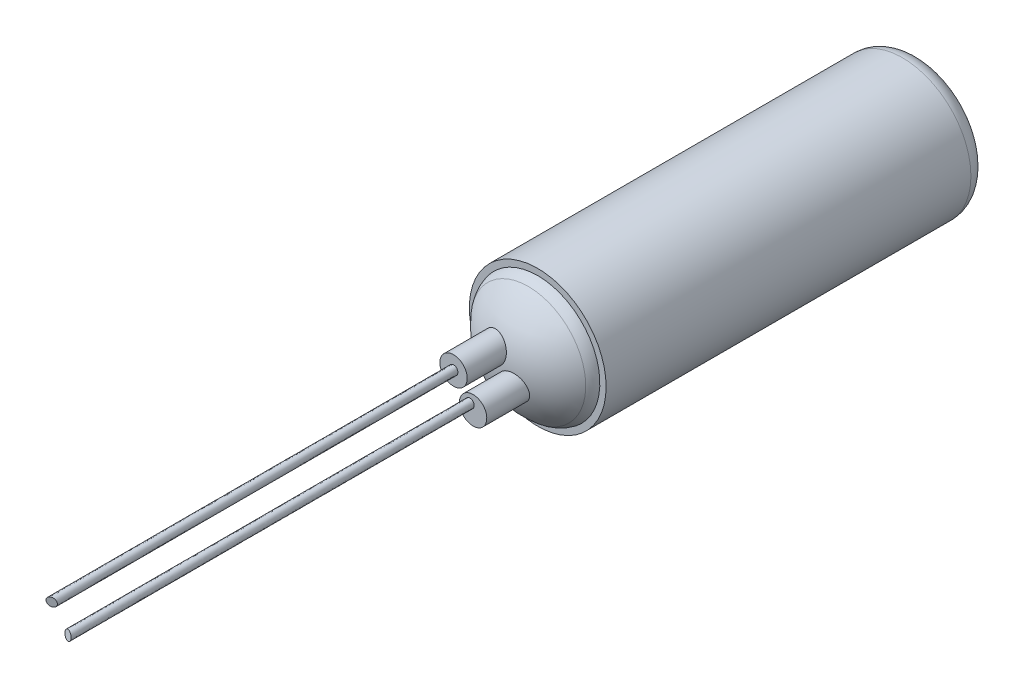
ISO-10303-21;
HEADER;
FILE_DESCRIPTION(('STEP AP214'),'2;1');
FILE_NAME('part.step','',(''),(''),'','','');
FILE_SCHEMA(('AUTOMOTIVE_DESIGN { 1 0 10303 214 1 1 1 1 }'));
ENDSEC;
DATA;
#1=APPLICATION_CONTEXT('core data for automotive mechanical design processes');
#2=APPLICATION_PROTOCOL_DEFINITION('international standard','automotive_design',2000,#1);
#3=PRODUCT_CONTEXT('',#1,'mechanical');
#4=PRODUCT('Part','Part','',(#3));
#5=PRODUCT_RELATED_PRODUCT_CATEGORY('part','',(#4));
#6=PRODUCT_DEFINITION_FORMATION('','',#4);
#7=PRODUCT_DEFINITION_CONTEXT('part definition',#1,'design');
#8=PRODUCT_DEFINITION('design','',#6,#7);
#9=PRODUCT_DEFINITION_SHAPE('','',#8);
#10=(LENGTH_UNIT() NAMED_UNIT(*) SI_UNIT(.MILLI.,.METRE.));
#11=(NAMED_UNIT(*) PLANE_ANGLE_UNIT() SI_UNIT($,.RADIAN.));
#12=(NAMED_UNIT(*) SI_UNIT($,.STERADIAN.) SOLID_ANGLE_UNIT());
#13=UNCERTAINTY_MEASURE_WITH_UNIT(LENGTH_MEASURE(1.E-05),#10,'distance_accuracy_value','');
#14=(GEOMETRIC_REPRESENTATION_CONTEXT(3) GLOBAL_UNCERTAINTY_ASSIGNED_CONTEXT((#13)) GLOBAL_UNIT_ASSIGNED_CONTEXT((#10,
#11,#12)) REPRESENTATION_CONTEXT('',''));
#15=CARTESIAN_POINT('',(0.,0.,0.));
#16=DIRECTION('',(0.,0.,1.));
#17=DIRECTION('',(1.,0.,0.));
#18=AXIS2_PLACEMENT_3D('',#15,#16,#17);
#19=CARTESIAN_POINT('',(3.98137501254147,6.56502224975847,9.95298394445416));
#20=DIRECTION('',(0.,0.,-1.));
#21=DIRECTION('',(-1.,0.,0.));
#22=AXIS2_PLACEMENT_3D('',#19,#20,#21);
#23=PLANE('',#22);
#24=CARTESIAN_POINT('',(3.98137501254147,5.04102224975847,9.95298394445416));
#25=DIRECTION('',(0.,0.,-1.));
#26=DIRECTION('',(-1.,0.,0.));
#27=AXIS2_PLACEMENT_3D('',#24,#25,#26);
#28=CIRCLE('',#27,1.38412585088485);
#29=CARTESIAN_POINT('',(2.59724916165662,5.04102224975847,9.95298394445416));
#30=VERTEX_POINT('',#29);
#31=EDGE_CURVE('E17',#30,#30,#28,.T.);
#32=ORIENTED_EDGE('',*,*,#31,.T.);
#33=EDGE_LOOP('',(#32));
#34=FACE_BOUND('',#33,.T.);
#35=CARTESIAN_POINT('',(3.98137501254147,5.04102224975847,9.95298394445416));
#36=DIRECTION('',(0.,0.,1.));
#37=DIRECTION('',(1.,0.,0.));
#38=AXIS2_PLACEMENT_3D('',#35,#36,#37);
#39=CIRCLE('',#38,1.524);
#40=CARTESIAN_POINT('',(5.50537501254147,5.04102224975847,9.95298394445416));
#41=VERTEX_POINT('',#40);
#42=EDGE_CURVE('E9',#41,#41,#39,.T.);
#43=ORIENTED_EDGE('',*,*,#42,.T.);
#44=EDGE_LOOP('',(#43));
#45=FACE_BOUND('',#44,.T.);
#46=ADVANCED_FACE('F14',(#34,#45),#23,.F.);
#47=CARTESIAN_POINT('',(3.98137501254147,5.04102224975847,12.7757059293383));
#48=DIRECTION('',(0.,0.,1.));
#49=DIRECTION('',(1.,0.,0.));
#50=AXIS2_PLACEMENT_3D('',#47,#48,#49);
#51=CYLINDRICAL_SURFACE('',#50,1.524);
#52=ORIENTED_EDGE('',*,*,#42,.F.);
#53=EDGE_LOOP('',(#52));
#54=FACE_BOUND('',#53,.T.);
#55=CARTESIAN_POINT('',(3.98137501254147,5.04102224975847,1.82498394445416));
#56=DIRECTION('',(0.,0.,1.));
#57=DIRECTION('',(1.,0.,0.));
#58=AXIS2_PLACEMENT_3D('',#55,#56,#57);
#59=CIRCLE('',#58,1.524);
#60=CARTESIAN_POINT('',(5.50537501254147,5.04102224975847,1.82498394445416));
#61=VERTEX_POINT('',#60);
#62=EDGE_CURVE('E23',#61,#61,#59,.T.);
#63=ORIENTED_EDGE('',*,*,#62,.T.);
#64=EDGE_LOOP('',(#63));
#65=FACE_BOUND('',#64,.T.);
#66=ADVANCED_FACE('F119',(#54,#65),#51,.T.);
#67=CARTESIAN_POINT('',(3.98137501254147,5.04102224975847,1.82498394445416));
#68=DIRECTION('',(0.,0.,1.));
#69=DIRECTION('',(1.,0.,0.));
#70=AXIS2_PLACEMENT_3D('',#67,#68,#69);
#71=TOROIDAL_SURFACE('',#70,1.143,0.381000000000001);
#72=ORIENTED_EDGE('',*,*,#62,.F.);
#73=EDGE_LOOP('',(#72));
#74=FACE_BOUND('',#73,.T.);
#75=CARTESIAN_POINT('',(3.98137501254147,5.04102224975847,1.44398394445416));
#76=DIRECTION('',(0.,0.,1.));
#77=DIRECTION('',(1.,0.,0.));
#78=AXIS2_PLACEMENT_3D('',#75,#76,#77);
#79=CIRCLE('',#78,1.14300000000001);
#80=CARTESIAN_POINT('',(5.12437501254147,5.04102224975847,1.44398394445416));
#81=VERTEX_POINT('',#80);
#82=EDGE_CURVE('E98',#81,#81,#79,.T.);
#83=ORIENTED_EDGE('',*,*,#82,.T.);
#84=EDGE_LOOP('',(#83));
#85=FACE_BOUND('',#84,.T.);
#86=ADVANCED_FACE('F116',(#74,#85),#71,.T.);
#87=CARTESIAN_POINT('',(3.98137501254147,6.18402224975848,1.44398394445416));
#88=DIRECTION('',(0.,0.,1.));
#89=DIRECTION('',(1.,0.,0.));
#90=AXIS2_PLACEMENT_3D('',#87,#88,#89);
#91=PLANE('',#90);
#92=ORIENTED_EDGE('',*,*,#82,.F.);
#93=EDGE_LOOP('',(#92));
#94=FACE_BOUND('',#93,.T.);
#95=ADVANCED_FACE('F112',(#94),#91,.F.);
#96=CARTESIAN_POINT('',(3.98137501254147,5.04102224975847,9.83934243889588));
#97=DIRECTION('',(0.,0.,-1.));
#98=DIRECTION('',(0.00892276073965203,0.999960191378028,0.));
#99=AXIS2_PLACEMENT_3D('',#96,#97,#98);
#100=TOROIDAL_SURFACE('',#99,0.889,0.508);
#101=CARTESIAN_POINT('',(3.98137501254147,5.04102224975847,10.1630746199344));
#102=DIRECTION('',(0.,0.,-1.));
#103=DIRECTION('',(0.00892276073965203,0.999960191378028,0.));
#104=AXIS2_PLACEMENT_3D('',#101,#102,#103);
#105=CIRCLE('',#104,1.28048623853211);
#106=CARTESIAN_POINT('',(3.99280048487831,6.32145751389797,10.1630746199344));
#107=VERTEX_POINT('',#106);
#108=EDGE_CURVE('E92',#107,#107,#105,.F.);
#109=ORIENTED_EDGE('',*,*,#108,.F.);
#110=EDGE_LOOP('',(#109));
#111=FACE_BOUND('',#110,.T.);
#112=ORIENTED_EDGE('',*,*,#31,.F.);
#113=EDGE_LOOP('',(#112));
#114=FACE_BOUND('',#113,.T.);
#115=ADVANCED_FACE('F106',(#111,#114),#100,.T.);
#116=CARTESIAN_POINT('',(3.98137501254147,5.04102224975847,9.10420061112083));
#117=DIRECTION('',(-0.00892276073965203,-0.999960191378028,0.));
#118=DIRECTION('',(0.999960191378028,-0.00892276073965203,0.));
#119=AXIS2_PLACEMENT_3D('',#116,#117,#118);
#120=SPHERICAL_SURFACE('',#119,1.66158333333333);
#121=CARTESIAN_POINT('',(3.98337896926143,4.54498127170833,10.6900122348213));
#122=CARTESIAN_POINT('',(3.97092117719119,4.55724621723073,10.6938642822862));
#123=CARTESIAN_POINT('',(3.95951601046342,4.5705897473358,10.697748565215));
#124=CARTESIAN_POINT('',(3.9391446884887,4.59905527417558,10.7054697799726));
#125=CARTESIAN_POINT('',(3.93018164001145,4.61417950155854,10.7093066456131));
#126=CARTESIAN_POINT('',(3.91497217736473,4.64577354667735,10.7168225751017));
#127=CARTESIAN_POINT('',(3.90872538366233,4.66224317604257,10.7205016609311));
#128=CARTESIAN_POINT('',(3.89915056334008,4.69605940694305,10.7275983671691));
#129=CARTESIAN_POINT('',(3.8958216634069,4.7134057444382,10.7310160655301));
#130=CARTESIAN_POINT('',(3.89222184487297,4.74833412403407,10.7374674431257));
#131=CARTESIAN_POINT('',(3.89192583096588,4.76591302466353,10.7405040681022));
#132=CARTESIAN_POINT('',(3.89437124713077,4.80093088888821,10.7461389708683));
#133=CARTESIAN_POINT('',(3.89711249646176,4.8183698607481,10.7487372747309));
#134=CARTESIAN_POINT('',(3.90549859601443,4.85222690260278,10.7533705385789));
#135=CARTESIAN_POINT('',(3.9110827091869,4.86865857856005,10.7554159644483));
#136=CARTESIAN_POINT('',(3.92498558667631,4.90038557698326,10.7589524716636));
#137=CARTESIAN_POINT('',(3.93330398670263,4.91568105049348,10.7604436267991));
#138=CARTESIAN_POINT('',(3.95224183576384,4.94435415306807,10.7628012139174));
#139=CARTESIAN_POINT('',(3.96280808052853,4.95776589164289,10.7636803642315));
#140=CARTESIAN_POINT('',(3.98604509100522,4.98265172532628,10.7648391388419));
#141=CARTESIAN_POINT('',(3.99871565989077,4.99412600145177,10.7651188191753));
#142=CARTESIAN_POINT('',(4.02561077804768,5.01465843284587,10.7650707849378));
#143=CARTESIAN_POINT('',(4.03981214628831,5.02374699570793,10.764751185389));
#144=CARTESIAN_POINT('',(4.06949705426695,5.03945422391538,10.7635298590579));
#145=CARTESIAN_POINT('',(4.08498056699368,5.04607294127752,10.7626281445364));
#146=CARTESIAN_POINT('',(4.11678102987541,5.05666570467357,10.7602688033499));
#147=CARTESIAN_POINT('',(4.13309774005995,5.06064050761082,10.7588113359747));
#148=CARTESIAN_POINT('',(4.16610842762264,5.06586050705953,10.7553814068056));
#149=CARTESIAN_POINT('',(4.1828024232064,5.06710557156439,10.7534089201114));
#150=CARTESIAN_POINT('',(4.21632005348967,5.06685841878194,10.7489747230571));
#151=CARTESIAN_POINT('',(4.23314264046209,5.06533122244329,10.7465071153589));
#152=CARTESIAN_POINT('',(4.26624412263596,5.05954518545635,10.7411658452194));
#153=CARTESIAN_POINT('',(4.28252296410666,5.05528607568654,10.7382921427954));
#154=CARTESIAN_POINT('',(4.31443491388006,5.04406495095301,10.7321510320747));
#155=CARTESIAN_POINT('',(4.33004759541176,5.03704864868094,10.7288766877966));
#156=CARTESIAN_POINT('',(4.35984140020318,5.02053899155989,10.7220709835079));
#157=CARTESIAN_POINT('',(4.37402236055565,5.01104535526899,10.7185395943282));
#158=CARTESIAN_POINT('',(4.40085887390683,4.98963375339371,10.7112370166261));
#159=CARTESIAN_POINT('',(4.41347648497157,4.97766939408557,10.7074623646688));
#160=CARTESIAN_POINT('',(4.436491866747,4.95178631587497,10.6998444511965));
#161=CARTESIAN_POINT('',(4.4468894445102,4.93786742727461,10.6960011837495));
#162=CARTESIAN_POINT('',(4.46529118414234,4.90827927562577,10.6883047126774));
#163=CARTESIAN_POINT('',(4.47326434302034,4.89259059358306,10.6844519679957));
#164=CARTESIAN_POINT('',(4.48640650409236,4.86004492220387,10.6768963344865));
#165=CARTESIAN_POINT('',(4.49157546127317,4.84318791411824,10.6731934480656));
#166=CARTESIAN_POINT('',(4.49893102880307,4.8088218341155,10.6660580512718));
#167=CARTESIAN_POINT('',(4.50112459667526,4.79131438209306,10.6626249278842));
#168=CARTESIAN_POINT('',(4.50245603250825,4.75611439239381,10.6561290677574));
#169=CARTESIAN_POINT('',(4.50159414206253,4.73842186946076,10.653066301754));
#170=CARTESIAN_POINT('',(4.49684402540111,4.70368022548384,10.6474637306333));
#171=CARTESIAN_POINT('',(4.49300811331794,4.68662527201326,10.6449158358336));
#172=CARTESIAN_POINT('',(4.48244926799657,4.65335624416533,10.6403674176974));
#173=CARTESIAN_POINT('',(4.47572676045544,4.63714204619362,10.6383668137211));
#174=CARTESIAN_POINT('',(4.45976756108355,4.60644286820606,10.6350288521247));
#175=CARTESIAN_POINT('',(4.45059734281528,4.59192498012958,10.6336762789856));
#176=CARTESIAN_POINT('',(4.42992403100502,4.56460641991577,10.6316119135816));
#177=CARTESIAN_POINT('',(4.41842124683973,4.55180552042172,10.6309000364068));
#178=CARTESIAN_POINT('',(4.39367124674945,4.5285507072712,10.6301516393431));
#179=CARTESIAN_POINT('',(4.38046432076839,4.51805431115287,10.6301016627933));
#180=CARTESIAN_POINT('',(4.35251129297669,4.49938614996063,10.6306441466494));
#181=CARTESIAN_POINT('',(4.33776527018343,4.49121426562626,10.6312365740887));
#182=CARTESIAN_POINT('',(4.30725064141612,4.47745923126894,10.6330368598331));
#183=CARTESIAN_POINT('',(4.29148841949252,4.47186143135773,10.6342411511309));
#184=CARTESIAN_POINT('',(4.25931362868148,4.46332148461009,10.6372206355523));
#185=CARTESIAN_POINT('',(4.24290106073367,4.46037933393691,10.638995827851));
#186=CARTESIAN_POINT('',(4.20969412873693,4.45718532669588,10.6430799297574));
#187=CARTESIAN_POINT('',(4.19289754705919,4.45696403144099,10.6453946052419));
#188=CARTESIAN_POINT('',(4.15955785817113,4.45926396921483,10.6504713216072));
#189=CARTESIAN_POINT('',(4.14301484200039,4.46178616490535,10.6532335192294));
#190=CARTESIAN_POINT('',(4.11024917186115,4.46956281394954,10.6591874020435));
#191=CARTESIAN_POINT('',(4.09404277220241,4.4748791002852,10.6623875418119));
#192=CARTESIAN_POINT('',(4.06280141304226,4.48810157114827,10.6690667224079));
#193=CARTESIAN_POINT('',(4.04776524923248,4.49600504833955,10.6725454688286));
#194=CARTESIAN_POINT('',(4.02447348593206,4.51083320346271,10.6783738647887));
#195=CARTESIAN_POINT('',(4.01575027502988,4.51705752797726,10.6806708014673));
#196=CARTESIAN_POINT('',(3.9990130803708,4.53038046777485,10.6853118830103));
#197=CARTESIAN_POINT('',(3.99099910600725,4.53747909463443,10.6876560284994));
#198=CARTESIAN_POINT('',(3.98337896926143,4.54498127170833,10.6900122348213));
#199=B_SPLINE_CURVE_WITH_KNOTS('',3,(#121,#122,#123,#124,#125,#126,#127,#128,#129,#130,#131,
#132,#133,#134,#135,#136,#137,#138,#139,#140,#141,#142,#143,#144,#145,#146,#147,#148,#149,#150,
#151,#152,#153,#154,#155,#156,#157,#158,#159,#160,#161,#162,#163,#164,#165,#166,#167,#168,#169,
#170,#171,#172,#173,#174,#175,#176,#177,#178,#179,#180,#181,#182,#183,#184,#185,#186,#187,#188,
#189,#190,#191,#192,#193,#194,#195,#196,#197,#198),.UNSPECIFIED.,.T.,.F.,(4,2,2,2,2,2,2,2,2,2,2,
2,2,2,2,2,2,2,2,2,2,2,2,2,2,2,2,2,2,2,2,2,2,2,2,2,2,2,4),(0.,0.053664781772,0.107397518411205,
0.161122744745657,0.214831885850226,0.268096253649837,0.321357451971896,0.373525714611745,
0.425687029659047,0.476729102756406,0.52776640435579,0.578117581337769,0.628467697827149,
0.67880339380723,0.729141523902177,0.780119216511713,0.831101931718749,0.883143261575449,
0.935190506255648,0.988322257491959,1.04145862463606,1.09524838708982,1.14903901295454,
1.20270363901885,1.25636402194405,1.30910133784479,1.36183087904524,1.41325296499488,
1.4646682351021,1.51503657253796,1.5654023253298,1.61547777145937,1.6655531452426,
1.71619047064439,1.76684556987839,1.81867203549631,1.87044444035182,1.90326948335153,
1.93609496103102),.UNSPECIFIED.);
#200=CARTESIAN_POINT('',(3.98337896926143,4.54498127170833,10.6900122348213));
#201=VERTEX_POINT('',#200);
#202=EDGE_CURVE('E93',#201,#201,#199,.T.);
#203=ORIENTED_EDGE('',*,*,#202,.T.);
#204=EDGE_LOOP('',(#203));
#205=FACE_BOUND('',#204,.T.);
#206=ORIENTED_EDGE('',*,*,#108,.T.);
#207=EDGE_LOOP('',(#206));
#208=FACE_BOUND('',#207,.T.);
#209=CARTESIAN_POINT('',(3.54192608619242,5.10206295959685,10.7054556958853));
#210=CARTESIAN_POINT('',(3.52979674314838,5.1146637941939,10.7016464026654));
#211=CARTESIAN_POINT('',(3.5187512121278,5.12831387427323,10.6977937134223));
#212=CARTESIAN_POINT('',(3.49914990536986,5.15732246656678,10.6901118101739));
#213=CARTESIAN_POINT('',(3.49059734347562,5.17268314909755,10.6862826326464));
#214=CARTESIAN_POINT('',(3.4762456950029,5.20467125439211,10.6787620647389));
#215=CARTESIAN_POINT('',(3.47044606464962,5.22129842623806,10.6750706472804));
#216=CARTESIAN_POINT('',(3.46178646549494,5.25534839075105,10.66793731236));
#217=CARTESIAN_POINT('',(3.45892562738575,5.27277094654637,10.6644953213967));
#218=CARTESIAN_POINT('',(3.45626359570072,5.30778423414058,10.6579932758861));
#219=CARTESIAN_POINT('',(3.45643965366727,5.3253727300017,10.6549305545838));
#220=CARTESIAN_POINT('',(3.45982783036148,5.36033090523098,10.6492591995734));
#221=CARTESIAN_POINT('',(3.46303974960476,5.3777005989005,10.6466505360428));
#222=CARTESIAN_POINT('',(3.47233888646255,5.41132536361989,10.6420302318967));
#223=CARTESIAN_POINT('',(3.47836252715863,5.42759640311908,10.6400069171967));
#224=CARTESIAN_POINT('',(3.49311323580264,5.45893165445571,10.6365563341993));
#225=CARTESIAN_POINT('',(3.50183989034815,5.47399605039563,10.6351289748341));
#226=CARTESIAN_POINT('',(3.52151633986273,5.50211005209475,10.6329503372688));
#227=CARTESIAN_POINT('',(3.53240779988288,5.51519931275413,10.6321836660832));
#228=CARTESIAN_POINT('',(3.55622942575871,5.53939350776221,10.6312974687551));
#229=CARTESIAN_POINT('',(3.56915938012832,5.55049864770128,10.631177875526));
#230=CARTESIAN_POINT('',(3.59647978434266,5.57025308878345,10.6315871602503));
#231=CARTESIAN_POINT('',(3.61084634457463,5.57893565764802,10.6321066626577));
#232=CARTESIAN_POINT('',(3.64077895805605,5.59381825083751,10.6337594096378));
#233=CARTESIAN_POINT('',(3.65634499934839,5.60001829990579,10.6348926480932));
#234=CARTESIAN_POINT('',(3.688265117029,5.60979037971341,10.6377356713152));
#235=CARTESIAN_POINT('',(3.70462075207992,5.61335696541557,10.6394466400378));
#236=CARTESIAN_POINT('',(3.73763297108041,5.61777018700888,10.6433861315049));
#237=CARTESIAN_POINT('',(3.75428957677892,5.61861662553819,10.645614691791));
#238=CARTESIAN_POINT('',(3.78773867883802,5.61758904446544,10.6505595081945));
#239=CARTESIAN_POINT('',(3.80452857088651,5.61566789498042,10.6532835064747));
#240=CARTESIAN_POINT('',(3.83750018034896,5.60910540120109,10.6591063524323));
#241=CARTESIAN_POINT('',(3.85368182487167,5.60446373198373,10.6622052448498));
#242=CARTESIAN_POINT('',(3.88539184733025,5.59246904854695,10.6687638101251));
#243=CARTESIAN_POINT('',(3.90089515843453,5.58505351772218,10.6722303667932));
#244=CARTESIAN_POINT('',(3.93040791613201,5.56775396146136,10.6793579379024));
#245=CARTESIAN_POINT('',(3.94441718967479,5.5578696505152,10.6830189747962));
#246=CARTESIAN_POINT('',(3.97083397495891,5.5356914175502,10.690507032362));
#247=CARTESIAN_POINT('',(3.98320383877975,5.52335324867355,10.6943359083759));
#248=CARTESIAN_POINT('',(4.00566181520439,5.49674643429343,10.7019811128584));
#249=CARTESIAN_POINT('',(4.01574978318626,5.48247766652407,10.7057974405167));
#250=CARTESIAN_POINT('',(4.0334207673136,5.45229250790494,10.7133400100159));
#251=CARTESIAN_POINT('',(4.04098460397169,5.43636465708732,10.7170653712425));
#252=CARTESIAN_POINT('',(4.05326873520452,5.40339911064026,10.7242919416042));
#253=CARTESIAN_POINT('',(4.05798908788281,5.38636143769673,10.7277931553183));
#254=CARTESIAN_POINT('',(4.06439651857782,5.35180083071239,10.7344462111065));
#255=CARTESIAN_POINT('',(4.06610705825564,5.33428274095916,10.7376005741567));
#256=CARTESIAN_POINT('',(4.06648287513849,5.29914456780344,10.7435010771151));
#257=CARTESIAN_POINT('',(4.06514844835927,5.28152449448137,10.746247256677));
#258=CARTESIAN_POINT('',(4.0594932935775,5.24704427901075,10.7512030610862));
#259=CARTESIAN_POINT('',(4.05522999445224,5.23017605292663,10.7534219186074));
#260=CARTESIAN_POINT('',(4.04387106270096,5.19735587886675,10.757324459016));
#261=CARTESIAN_POINT('',(4.03677579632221,5.18140381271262,10.7590082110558));
#262=CARTESIAN_POINT('',(4.02012412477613,5.15123675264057,10.7617598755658));
#263=CARTESIAN_POINT('',(4.01062443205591,5.13699158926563,10.7628403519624));
#264=CARTESIAN_POINT('',(3.98935661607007,5.11027236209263,10.7644090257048));
#265=CARTESIAN_POINT('',(3.97758871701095,5.09779812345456,10.7648972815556));
#266=CARTESIAN_POINT('',(3.95231811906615,5.07516622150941,10.7652642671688));
#267=CARTESIAN_POINT('',(3.93884437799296,5.06497634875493,10.7651521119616));
#268=CARTESIAN_POINT('',(3.91041368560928,5.04696528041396,10.7643426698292));
#269=CARTESIAN_POINT('',(3.89545678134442,5.03914400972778,10.7636454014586));
#270=CARTESIAN_POINT('',(3.86453256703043,5.02609961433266,10.7616885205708));
#271=CARTESIAN_POINT('',(3.84856805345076,5.0208696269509,10.7604304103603));
#272=CARTESIAN_POINT('',(3.81604651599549,5.01310349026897,10.7573878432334));
#273=CARTESIAN_POINT('',(3.79948949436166,5.01056733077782,10.7556033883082));
#274=CARTESIAN_POINT('',(3.76606884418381,5.0082201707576,10.7515360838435));
#275=CARTESIAN_POINT('',(3.74920381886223,5.00843786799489,10.7492482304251));
#276=CARTESIAN_POINT('',(3.71579730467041,5.01163173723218,10.7442468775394));
#277=CARTESIAN_POINT('',(3.69925592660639,5.0146088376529,10.7415332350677));
#278=CARTESIAN_POINT('',(3.66661878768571,5.02329719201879,10.7356947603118));
#279=CARTESIAN_POINT('',(3.650538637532,5.02906213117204,10.7325627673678));
#280=CARTESIAN_POINT('',(3.61962350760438,5.04315730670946,10.7260172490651));
#281=CARTESIAN_POINT('',(3.6047872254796,5.05148481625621,10.7226040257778));
#282=CARTESIAN_POINT('',(3.58192580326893,5.06694359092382,10.7168836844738));
#283=CARTESIAN_POINT('',(3.57340846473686,5.0733812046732,10.7146334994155));
#284=CARTESIAN_POINT('',(3.55710211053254,5.08710380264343,10.7100794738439));
#285=CARTESIAN_POINT('',(3.54931310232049,5.09438879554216,10.7077756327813));
#286=CARTESIAN_POINT('',(3.54192608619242,5.10206295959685,10.7054556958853));
#287=B_SPLINE_CURVE_WITH_KNOTS('',3,(#209,#210,#211,#212,#213,#214,#215,#216,#217,#218,#219,
#220,#221,#222,#223,#224,#225,#226,#227,#228,#229,#230,#231,#232,#233,#234,#235,#236,#237,#238,
#239,#240,#241,#242,#243,#244,#245,#246,#247,#248,#249,#250,#251,#252,#253,#254,#255,#256,#257,
#258,#259,#260,#261,#262,#263,#264,#265,#266,#267,#268,#269,#270,#271,#272,#273,#274,#275,#276,
#277,#278,#279,#280,#281,#282,#283,#284,#285,#286),.UNSPECIFIED.,.T.,.F.,(4,2,2,2,2,2,2,2,2,2,2,
2,2,2,2,2,2,2,2,2,2,2,2,2,2,2,2,2,2,2,2,2,2,2,2,2,2,2,4),(0.,0.0536606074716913,
0.107390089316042,0.161108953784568,0.214811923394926,0.268112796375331,0.321410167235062,
0.373556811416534,0.425695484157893,0.476583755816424,0.527466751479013,0.577612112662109,
0.627756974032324,0.678005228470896,0.72825712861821,0.779374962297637,0.830498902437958,
0.882852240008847,0.935211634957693,0.988618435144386,1.04202861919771,1.09583585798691,
1.14964199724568,1.20302682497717,1.25640646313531,1.30876824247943,1.36112325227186,
1.41234282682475,1.4635573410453,1.51399657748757,1.56443421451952,1.61473755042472,
1.66504069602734,1.71586847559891,1.76671336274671,1.81857890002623,1.87038943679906,
1.90306950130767,1.93574990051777),.UNSPECIFIED.);
#288=CARTESIAN_POINT('',(3.54192608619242,5.10206295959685,10.7054556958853));
#289=VERTEX_POINT('',#288);
#290=EDGE_CURVE('E83',#289,#289,#287,.T.);
#291=ORIENTED_EDGE('',*,*,#290,.T.);
#292=EDGE_LOOP('',(#291));
#293=FACE_BOUND('',#292,.T.);
#294=ADVANCED_FACE('F100',(#205,#208,#293),#120,.T.);
#295=CARTESIAN_POINT('',(4.12399185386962,4.8616252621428,20.5613266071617));
#296=DIRECTION('',(-0.283187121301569,0.101279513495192,0.953702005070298));
#297=DIRECTION('',(-0.958733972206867,-0.00378301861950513,-0.284279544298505));
#298=AXIS2_PLACEMENT_3D('',#295,#296,#297);
#299=PLANE('',#298);
#300=CARTESIAN_POINT('',(4.12399185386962,4.8616252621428,20.5613266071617));
#301=DIRECTION('',(-0.283187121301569,0.101279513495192,0.953702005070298));
#302=DIRECTION('',(-0.958733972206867,-0.00378301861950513,-0.284279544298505));
#303=AXIS2_PLACEMENT_3D('',#300,#301,#302);
#304=CIRCLE('',#303,0.1016);
#305=CARTESIAN_POINT('',(4.0265844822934,4.86124090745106,20.532443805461));
#306=VERTEX_POINT('',#305);
#307=EDGE_CURVE('E33',#306,#306,#304,.T.);
#308=ORIENTED_EDGE('',*,*,#307,.T.);
#309=EDGE_LOOP('',(#308));
#310=FACE_BOUND('',#309,.T.);
#311=ADVANCED_FACE('F105',(#310),#299,.T.);
#312=CARTESIAN_POINT('',(4.0265844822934,4.86124090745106,10.372443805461));
#313=CARTESIAN_POINT('',(4.0265844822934,4.86124090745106,20.532443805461));
#314=CARTESIAN_POINT('',(4.02146712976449,4.65908722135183,10.3923922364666));
#315=CARTESIAN_POINT('',(4.02146712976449,4.65908722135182,20.5523922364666));
#316=CARTESIAN_POINT('',(4.21628187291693,4.65985593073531,10.4501578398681));
#317=CARTESIAN_POINT('',(4.21628187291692,4.65985593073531,20.6101578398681));
#318=CARTESIAN_POINT('',(4.22139922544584,4.86200961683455,10.4302094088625));
#319=CARTESIAN_POINT('',(4.22139922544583,4.86200961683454,20.5902094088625));
#320=CARTESIAN_POINT('',(4.22651657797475,5.06416330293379,10.4102609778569));
#321=CARTESIAN_POINT('',(4.22651657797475,5.06416330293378,20.5702609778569));
#322=CARTESIAN_POINT('',(4.03170183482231,5.0633945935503,10.3524953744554));
#323=CARTESIAN_POINT('',(4.03170183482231,5.0633945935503,20.5124953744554));
#324=CARTESIAN_POINT('',(4.0265844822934,4.86124090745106,10.372443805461));
#325=CARTESIAN_POINT('',(4.0265844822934,4.86124090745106,20.532443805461));
#326=(BOUNDED_SURFACE() B_SPLINE_SURFACE(3,1,((#312,#313),(#314,#315),(#316,#317),(#318,#319),
(#320,#321),(#322,#323),(#324,#325)),.UNSPECIFIED.,.T.,.F.,.F.) B_SPLINE_SURFACE_WITH_KNOTS((4,
3,4),(2,2),(0.,0.5,1.),(0.,1.),
.UNSPECIFIED.) GEOMETRIC_REPRESENTATION_ITEM() RATIONAL_B_SPLINE_SURFACE(((1.,1.),
(0.333333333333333,0.333333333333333),(0.333333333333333,0.333333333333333),(1.,1.),
(0.333333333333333,0.333333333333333),(0.333333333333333,0.333333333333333),(1.,1.))) REPRESENTATION_ITEM('') SURFACE());
#327=CARTESIAN_POINT('',(4.0265844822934,4.86124090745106,11.6086924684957));
#328=CARTESIAN_POINT('',(4.02689284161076,4.87314287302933,11.6086924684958));
#329=CARTESIAN_POINT('',(4.02923846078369,4.88504019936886,11.6086924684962));
#330=CARTESIAN_POINT('',(4.03771014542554,4.90737166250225,11.6086924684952));
#331=CARTESIAN_POINT('',(4.04383581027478,4.91780595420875,11.6086924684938));
#332=CARTESIAN_POINT('',(4.05922695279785,4.93602279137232,11.6086924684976));
#333=CARTESIAN_POINT('',(4.06848659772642,4.94381020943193,11.6086924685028));
#334=CARTESIAN_POINT('',(4.08884312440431,4.95548476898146,11.6086924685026));
#335=CARTESIAN_POINT('',(4.09987445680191,4.95948490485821,11.6086924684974));
#336=CARTESIAN_POINT('',(4.12212240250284,4.96321539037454,11.608692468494));
#337=CARTESIAN_POINT('',(4.13330635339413,4.96313626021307,11.6086924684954));
#338=CARTESIAN_POINT('',(4.15450829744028,4.95915514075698,11.6086924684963));
#339=CARTESIAN_POINT('',(4.16455508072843,4.95540684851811,11.6086924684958));
#340=CARTESIAN_POINT('',(4.18266255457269,4.94484384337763,11.6086924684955));
#341=CARTESIAN_POINT('',(4.19075123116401,4.93807683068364,11.6086924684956));
#342=CARTESIAN_POINT('',(4.20442343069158,4.92219591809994,11.6086924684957));
#343=CARTESIAN_POINT('',(4.20996702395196,4.91304792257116,11.6086924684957));
#344=CARTESIAN_POINT('',(4.21807438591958,4.89311903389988,11.6086924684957));
#345=CARTESIAN_POINT('',(4.22051620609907,4.88228910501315,11.6086924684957));
#346=CARTESIAN_POINT('',(4.22195308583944,4.85991661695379,11.6086924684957));
#347=CARTESIAN_POINT('',(4.2207860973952,4.84836406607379,11.6086924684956));
#348=CARTESIAN_POINT('',(4.21475084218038,4.82584119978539,11.6086924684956));
#349=CARTESIAN_POINT('',(4.20975637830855,4.81490468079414,11.6086924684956));
#350=CARTESIAN_POINT('',(4.19637409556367,4.79520072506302,11.6086924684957));
#351=CARTESIAN_POINT('',(4.18795825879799,4.78645218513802,11.6086924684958));
#352=CARTESIAN_POINT('',(4.16882367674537,4.77254751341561,11.6086924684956));
#353=CARTESIAN_POINT('',(4.15816135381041,4.76731456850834,11.6086924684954));
#354=CARTESIAN_POINT('',(4.13615080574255,4.7611086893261,11.6086924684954));
#355=CARTESIAN_POINT('',(4.12485342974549,4.75995838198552,11.6086924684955));
#356=CARTESIAN_POINT('',(4.10306875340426,4.76167561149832,11.6086924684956));
#357=CARTESIAN_POINT('',(4.09256778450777,4.76436646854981,11.6086924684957));
#358=CARTESIAN_POINT('',(4.07334802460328,4.77305161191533,11.6086924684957));
#359=CARTESIAN_POINT('',(4.06459230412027,4.77896451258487,11.6086924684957));
#360=CARTESIAN_POINT('',(4.04943974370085,4.79334444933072,11.6086924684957));
#361=CARTESIAN_POINT('',(4.0430576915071,4.80182691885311,11.6086924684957));
#362=CARTESIAN_POINT('',(4.03312748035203,4.82067443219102,11.6086924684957));
#363=CARTESIAN_POINT('',(4.02967833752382,4.83109177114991,11.6086924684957));
#364=CARTESIAN_POINT('',(4.02685892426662,4.84818602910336,11.6086924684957));
#365=CARTESIAN_POINT('',(4.02641538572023,4.85471416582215,11.6086924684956));
#366=CARTESIAN_POINT('',(4.0265844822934,4.86124090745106,11.6086924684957));
#367=B_SPLINE_CURVE_WITH_KNOTS('',3,(#327,#328,#329,#330,#331,#332,#333,#334,#335,#336,#337,
#338,#339,#340,#341,#342,#343,#344,#345,#346,#347,#348,#349,#350,#351,#352,#353,#354,#355,#356,
#357,#358,#359,#360,#361,#362,#363,#364,#365,#366),.UNSPECIFIED.,.T.,.F.,(4,2,2,2,2,2,2,2,2,2,2,
2,2,2,2,2,2,2,2,4),(0.,0.0356379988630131,0.0712722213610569,0.106840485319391,
0.141310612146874,0.174172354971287,0.205713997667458,0.236773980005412,0.268305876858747,
0.301042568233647,0.335270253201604,0.370677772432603,0.406381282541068,0.441276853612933,
0.474636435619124,0.506510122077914,0.537613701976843,0.568907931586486,0.601220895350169,
0.620763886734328),.UNSPECIFIED.);
#368=CARTESIAN_POINT('',(4.0265844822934,4.86124090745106,11.6086924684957));
#369=VERTEX_POINT('',#368);
#370=EDGE_CURVE('E154',#369,#369,#367,.T.);
#371=ORIENTED_EDGE('',*,*,#370,.F.);
#372=EDGE_LOOP('',(#371));
#373=FACE_BOUND('',#372,.T.);
#374=ORIENTED_EDGE('',*,*,#307,.F.);
#375=EDGE_LOOP('',(#374));
#376=FACE_BOUND('',#375,.T.);
#377=ADVANCED_FACE('F159',(#373,#376),#326,.T.);
#378=CARTESIAN_POINT('',(4.19720821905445,4.76219105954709,11.6086924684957));
#379=DIRECTION('',(0.,0.,1.));
#380=DIRECTION('',(0.0520348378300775,-0.998645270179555,0.));
#381=AXIS2_PLACEMENT_3D('',#378,#379,#380);
#382=PLANE('',#381);
#383=ORIENTED_EDGE('',*,*,#370,.T.);
#384=EDGE_LOOP('',(#383));
#385=FACE_BOUND('',#384,.T.);
#386=CARTESIAN_POINT('',(4.19720821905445,4.76219105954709,11.6086924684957));
#387=DIRECTION('',(0.,0.,1.));
#388=DIRECTION('',(0.998645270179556,0.0520348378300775,0.));
#389=AXIS2_PLACEMENT_3D('',#386,#387,#388);
#390=CIRCLE('',#389,0.3048);
#391=CARTESIAN_POINT('',(4.50159529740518,4.7780512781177,11.6086924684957));
#392=VERTEX_POINT('',#391);
#393=EDGE_CURVE('E54',#392,#392,#390,.T.);
#394=ORIENTED_EDGE('',*,*,#393,.T.);
#395=EDGE_LOOP('',(#394));
#396=FACE_BOUND('',#395,.T.);
#397=ADVANCED_FACE('F163',(#385,#396),#382,.T.);
#398=CARTESIAN_POINT('',(4.19720821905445,4.76219105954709,11.6086924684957));
#399=DIRECTION('',(0.,0.,-1.));
#400=DIRECTION('',(-0.0520348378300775,0.998645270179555,0.));
#401=AXIS2_PLACEMENT_3D('',#398,#399,#400);
#402=CYLINDRICAL_SURFACE('',#401,0.3048);
#403=ORIENTED_EDGE('',*,*,#202,.F.);
#404=EDGE_LOOP('',(#403));
#405=FACE_BOUND('',#404,.T.);
#406=ORIENTED_EDGE('',*,*,#393,.F.);
#407=EDGE_LOOP('',(#406));
#408=FACE_BOUND('',#407,.T.);
#409=ADVANCED_FACE('F75',(#405,#408),#402,.T.);
#410=CARTESIAN_POINT('',(3.76151242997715,5.31345093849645,11.6086924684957));
#411=DIRECTION('',(0.,0.,1.));
#412=DIRECTION('',(0.521860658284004,-0.853030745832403,0.));
#413=AXIS2_PLACEMENT_3D('',#410,#411,#412);
#414=PLANE('',#413);
#415=CARTESIAN_POINT('',(3.85867661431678,5.32142622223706,11.6086924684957));
#416=CARTESIAN_POINT('',(3.85836825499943,5.30952425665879,11.6086924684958));
#417=CARTESIAN_POINT('',(3.8560226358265,5.29762693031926,11.6086924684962));
#418=CARTESIAN_POINT('',(3.84755095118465,5.27529546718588,11.6086924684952));
#419=CARTESIAN_POINT('',(3.84142528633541,5.26486117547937,11.6086924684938));
#420=CARTESIAN_POINT('',(3.82603414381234,5.2466443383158,11.6086924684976));
#421=CARTESIAN_POINT('',(3.81677449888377,5.23885692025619,11.6086924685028));
#422=CARTESIAN_POINT('',(3.79641797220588,5.22718236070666,11.6086924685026));
#423=CARTESIAN_POINT('',(3.78538663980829,5.22318222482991,11.6086924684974));
#424=CARTESIAN_POINT('',(3.76313869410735,5.21945173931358,11.608692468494));
#425=CARTESIAN_POINT('',(3.75195474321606,5.21953086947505,11.6086924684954));
#426=CARTESIAN_POINT('',(3.73075279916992,5.22351198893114,11.6086924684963));
#427=CARTESIAN_POINT('',(3.72070601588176,5.22726028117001,11.6086924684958));
#428=CARTESIAN_POINT('',(3.7025985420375,5.23782328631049,11.6086924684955));
#429=CARTESIAN_POINT('',(3.69450986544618,5.24459029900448,11.6086924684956));
#430=CARTESIAN_POINT('',(3.68083766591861,5.26047121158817,11.6086924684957));
#431=CARTESIAN_POINT('',(3.67529407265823,5.26961920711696,11.6086924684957));
#432=CARTESIAN_POINT('',(3.6671867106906,5.28954809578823,11.6086924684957));
#433=CARTESIAN_POINT('',(3.66474489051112,5.30037802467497,11.6086924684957));
#434=CARTESIAN_POINT('',(3.66330801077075,5.32275051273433,11.6086924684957));
#435=CARTESIAN_POINT('',(3.66447499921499,5.33430306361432,11.6086924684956));
#436=CARTESIAN_POINT('',(3.67051025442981,5.35682592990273,11.6086924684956));
#437=CARTESIAN_POINT('',(3.67550471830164,5.36776244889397,11.6086924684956));
#438=CARTESIAN_POINT('',(3.68888700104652,5.38746640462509,11.6086924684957));
#439=CARTESIAN_POINT('',(3.6973028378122,5.3962149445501,11.6086924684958));
#440=CARTESIAN_POINT('',(3.71643741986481,5.41011961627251,11.6086924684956));
#441=CARTESIAN_POINT('',(3.72709974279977,5.41535256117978,11.6086924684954));
#442=CARTESIAN_POINT('',(3.74911029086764,5.42155844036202,11.6086924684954));
#443=CARTESIAN_POINT('',(3.76040766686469,5.4227087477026,11.6086924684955));
#444=CARTESIAN_POINT('',(3.78219234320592,5.4209915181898,11.6086924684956));
#445=CARTESIAN_POINT('',(3.79269331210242,5.41830066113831,11.6086924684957));
#446=CARTESIAN_POINT('',(3.81191307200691,5.40961551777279,11.6086924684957));
#447=CARTESIAN_POINT('',(3.82066879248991,5.40370261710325,11.6086924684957));
#448=CARTESIAN_POINT('',(3.83582135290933,5.38932268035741,11.6086924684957));
#449=CARTESIAN_POINT('',(3.84220340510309,5.38084021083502,11.6086924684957));
#450=CARTESIAN_POINT('',(3.85213361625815,5.3619926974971,11.6086924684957));
#451=CARTESIAN_POINT('',(3.85558275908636,5.35157535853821,11.6086924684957));
#452=CARTESIAN_POINT('',(3.85840217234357,5.33448110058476,11.6086924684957));
#453=CARTESIAN_POINT('',(3.85884571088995,5.32795296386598,11.6086924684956));
#454=CARTESIAN_POINT('',(3.85867661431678,5.32142622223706,11.6086924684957));
#455=B_SPLINE_CURVE_WITH_KNOTS('',3,(#415,#416,#417,#418,#419,#420,#421,#422,#423,#424,#425,
#426,#427,#428,#429,#430,#431,#432,#433,#434,#435,#436,#437,#438,#439,#440,#441,#442,#443,#444,
#445,#446,#447,#448,#449,#450,#451,#452,#453,#454),.UNSPECIFIED.,.T.,.F.,(4,2,2,2,2,2,2,2,2,2,2,
2,2,2,2,2,2,2,2,4),(0.,0.0356379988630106,0.0712722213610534,0.106840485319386,0.14131061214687,
0.174172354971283,0.205713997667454,0.236773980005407,0.268305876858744,0.301042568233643,
0.335270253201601,0.370677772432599,0.406381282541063,0.441276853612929,0.474636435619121,
0.50651012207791,0.537613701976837,0.568907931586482,0.601220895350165,0.620763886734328),.UNSPECIFIED.);
#456=CARTESIAN_POINT('',(3.85867661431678,5.32142622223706,11.6086924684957));
#457=VERTEX_POINT('',#456);
#458=EDGE_CURVE('E43',#457,#457,#455,.T.);
#459=ORIENTED_EDGE('',*,*,#458,.T.);
#460=EDGE_LOOP('',(#459));
#461=FACE_BOUND('',#460,.T.);
#462=CARTESIAN_POINT('',(3.76151242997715,5.31345093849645,11.6086924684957));
#463=DIRECTION('',(0.,0.,1.));
#464=DIRECTION('',(0.853030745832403,0.521860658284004,0.));
#465=AXIS2_PLACEMENT_3D('',#462,#463,#464);
#466=CIRCLE('',#465,0.3048);
#467=CARTESIAN_POINT('',(4.02151620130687,5.47251406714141,11.6086924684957));
#468=VERTEX_POINT('',#467);
#469=EDGE_CURVE('E44',#468,#468,#466,.T.);
#470=ORIENTED_EDGE('',*,*,#469,.T.);
#471=EDGE_LOOP('',(#470));
#472=FACE_BOUND('',#471,.T.);
#473=ADVANCED_FACE('F70',(#461,#472),#414,.T.);
#474=CARTESIAN_POINT('',(3.76151242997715,5.31345093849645,11.6086924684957));
#475=DIRECTION('',(0.,0.,-1.));
#476=DIRECTION('',(-0.521860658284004,0.853030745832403,0.));
#477=AXIS2_PLACEMENT_3D('',#474,#475,#476);
#478=CYLINDRICAL_SURFACE('',#477,0.3048);
#479=ORIENTED_EDGE('',*,*,#290,.F.);
#480=EDGE_LOOP('',(#479));
#481=FACE_BOUND('',#480,.T.);
#482=ORIENTED_EDGE('',*,*,#469,.F.);
#483=EDGE_LOOP('',(#482));
#484=FACE_BOUND('',#483,.T.);
#485=ADVANCED_FACE('F74',(#481,#484),#478,.T.);
#486=CARTESIAN_POINT('',(3.76126924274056,5.32104186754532,20.5619230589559));
#487=DIRECTION('',(0.283187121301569,-0.101279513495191,0.953702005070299));
#488=DIRECTION('',(0.958733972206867,0.00378301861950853,-0.284279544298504));
#489=AXIS2_PLACEMENT_3D('',#486,#487,#488);
#490=PLANE('',#489);
#491=CARTESIAN_POINT('',(3.76126924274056,5.32104186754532,20.5619230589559));
#492=DIRECTION('',(0.283187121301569,-0.101279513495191,0.953702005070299));
#493=DIRECTION('',(0.958733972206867,0.00378301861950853,-0.284279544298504));
#494=AXIS2_PLACEMENT_3D('',#491,#492,#493);
#495=CIRCLE('',#494,0.1016);
#496=CARTESIAN_POINT('',(3.85867661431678,5.32142622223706,20.5330402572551));
#497=VERTEX_POINT('',#496);
#498=EDGE_CURVE('E39',#497,#497,#495,.T.);
#499=ORIENTED_EDGE('',*,*,#498,.T.);
#500=EDGE_LOOP('',(#499));
#501=FACE_BOUND('',#500,.T.);
#502=ADVANCED_FACE('F40',(#501),#490,.T.);
#503=CARTESIAN_POINT('',(3.85867661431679,5.32142622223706,10.3730402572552));
#504=CARTESIAN_POINT('',(3.85867661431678,5.32142622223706,20.5330402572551));
#505=CARTESIAN_POINT('',(3.8637939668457,5.52357990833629,10.3929886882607));
#506=CARTESIAN_POINT('',(3.86379396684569,5.5235799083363,20.5529886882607));
#507=CARTESIAN_POINT('',(3.66897922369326,5.52281119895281,10.4507542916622));
#508=CARTESIAN_POINT('',(3.66897922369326,5.52281119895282,20.6107542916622));
#509=CARTESIAN_POINT('',(3.66386187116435,5.32065751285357,10.4308058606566));
#510=CARTESIAN_POINT('',(3.66386187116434,5.32065751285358,20.5908058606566));
#511=CARTESIAN_POINT('',(3.65874451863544,5.11850382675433,10.410857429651));
#512=CARTESIAN_POINT('',(3.65874451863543,5.11850382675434,20.570857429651));
#513=CARTESIAN_POINT('',(3.85355926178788,5.11927253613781,10.3530918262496));
#514=CARTESIAN_POINT('',(3.85355926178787,5.11927253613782,20.5130918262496));
#515=CARTESIAN_POINT('',(3.85867661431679,5.32142622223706,10.3730402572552));
#516=CARTESIAN_POINT('',(3.85867661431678,5.32142622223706,20.5330402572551));
#517=(BOUNDED_SURFACE() B_SPLINE_SURFACE(3,1,((#503,#504),(#505,#506),(#507,#508),(#509,#510),
(#511,#512),(#513,#514),(#515,#516)),.UNSPECIFIED.,.T.,.F.,.F.) B_SPLINE_SURFACE_WITH_KNOTS((4,
3,4),(2,2),(0.,0.5,1.),(0.,1.),
.UNSPECIFIED.) GEOMETRIC_REPRESENTATION_ITEM() RATIONAL_B_SPLINE_SURFACE(((1.,1.),
(0.333333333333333,0.333333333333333),(0.333333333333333,0.333333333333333),(1.,1.),
(0.333333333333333,0.333333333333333),(0.333333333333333,0.333333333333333),(1.,1.))) REPRESENTATION_ITEM('') SURFACE());
#518=ORIENTED_EDGE('',*,*,#458,.F.);
#519=EDGE_LOOP('',(#518));
#520=FACE_BOUND('',#519,.T.);
#521=ORIENTED_EDGE('',*,*,#498,.F.);
#522=EDGE_LOOP('',(#521));
#523=FACE_BOUND('',#522,.T.);
#524=ADVANCED_FACE('F64',(#520,#523),#517,.T.);
#525=CLOSED_SHELL('',(#46,#66,#86,#95,#115,#294,#311,#377,#397,#409,#473,#485,#502,#524));
#526=MANIFOLD_SOLID_BREP('B1',#525);
#527=ADVANCED_BREP_SHAPE_REPRESENTATION('',(#18,#526),#14);
#528=SHAPE_DEFINITION_REPRESENTATION(#9,#527);
ENDSEC;
END-ISO-10303-21;
